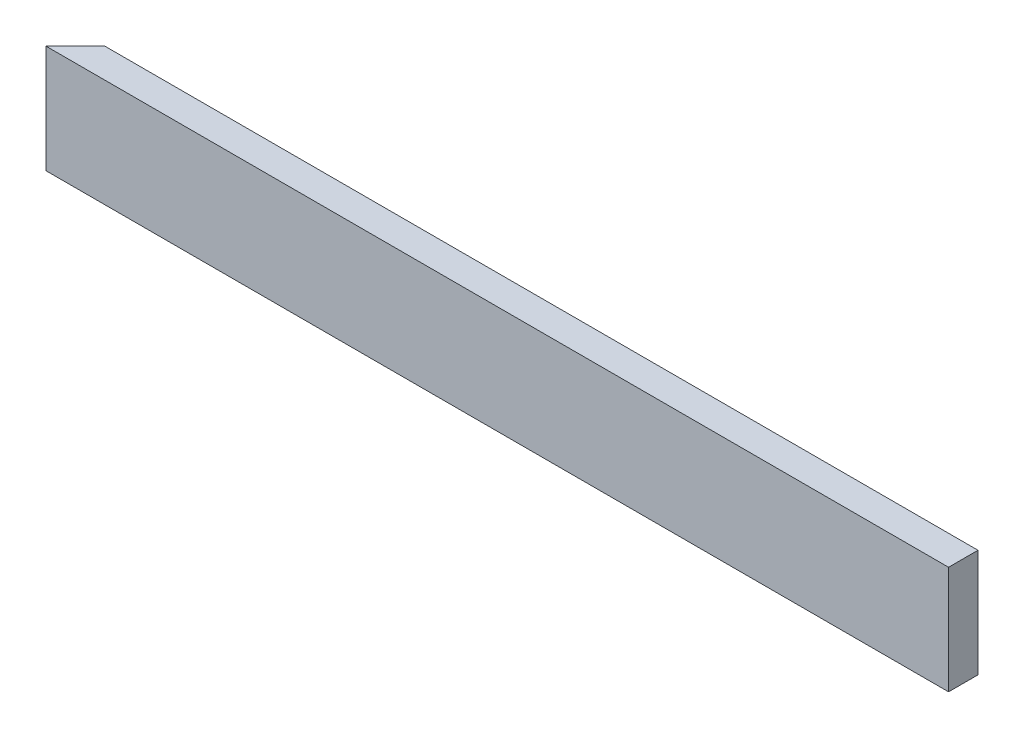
from build123d import *

# Parameters (mm, degrees)
BOSS_EXTRUDE1_DEPTH = 139.7


with BuildPart() as part:
    # Sketch2 → Boss-Extrude1 (new body)
    with BuildSketch(Plane(origin=(0, 0, 0), x_dir=(1, 0, 0), z_dir=(0, 1, 0))):
        Polygon((0, 0), (0, -38.1), (-1168.4, -38.1), (-1130.3, 0), align=None)
    extrude(amount=BOSS_EXTRUDE1_DEPTH)


solid = part.part
